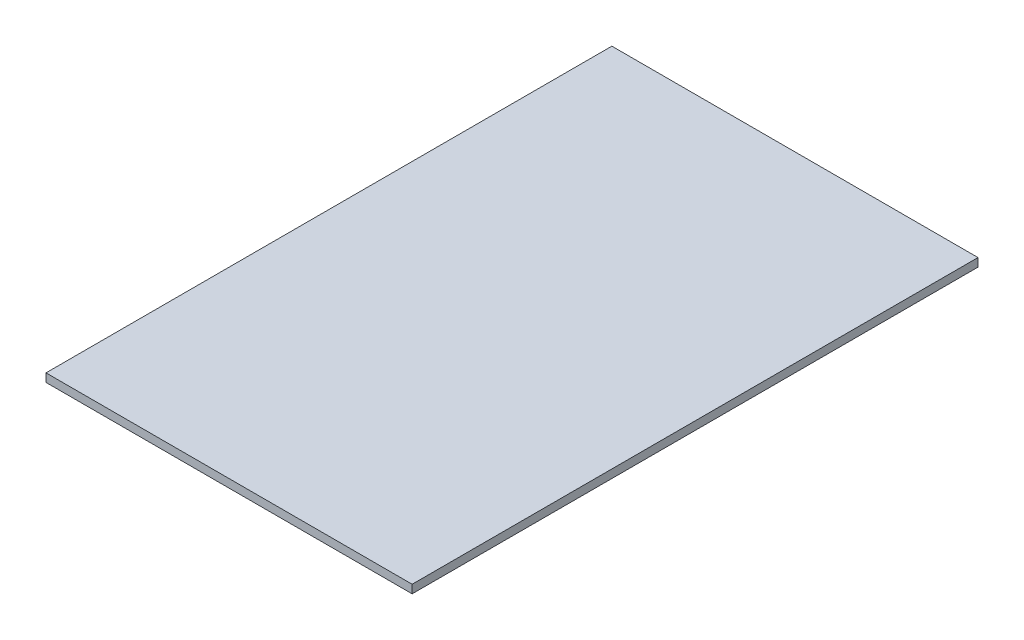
ISO-10303-21;
HEADER;
FILE_DESCRIPTION(('STEP AP214'),'2;1');
FILE_NAME('part.step','',(''),(''),'','','');
FILE_SCHEMA(('AUTOMOTIVE_DESIGN { 1 0 10303 214 1 1 1 1 }'));
ENDSEC;
DATA;
#1=APPLICATION_CONTEXT('core data for automotive mechanical design processes');
#2=APPLICATION_PROTOCOL_DEFINITION('international standard','automotive_design',2000,#1);
#3=PRODUCT_CONTEXT('',#1,'mechanical');
#4=PRODUCT('Part','Part','',(#3));
#5=PRODUCT_RELATED_PRODUCT_CATEGORY('part','',(#4));
#6=PRODUCT_DEFINITION_FORMATION('','',#4);
#7=PRODUCT_DEFINITION_CONTEXT('part definition',#1,'design');
#8=PRODUCT_DEFINITION('design','',#6,#7);
#9=PRODUCT_DEFINITION_SHAPE('','',#8);
#10=(LENGTH_UNIT() NAMED_UNIT(*) SI_UNIT(.MILLI.,.METRE.));
#11=(NAMED_UNIT(*) PLANE_ANGLE_UNIT() SI_UNIT($,.RADIAN.));
#12=(NAMED_UNIT(*) SI_UNIT($,.STERADIAN.) SOLID_ANGLE_UNIT());
#13=UNCERTAINTY_MEASURE_WITH_UNIT(LENGTH_MEASURE(1.E-05),#10,'distance_accuracy_value','');
#14=(GEOMETRIC_REPRESENTATION_CONTEXT(3) GLOBAL_UNCERTAINTY_ASSIGNED_CONTEXT((#13)) GLOBAL_UNIT_ASSIGNED_CONTEXT((#10,
#11,#12)) REPRESENTATION_CONTEXT('',''));
#15=CARTESIAN_POINT('',(0.,0.,0.));
#16=DIRECTION('',(0.,0.,1.));
#17=DIRECTION('',(1.,0.,0.));
#18=AXIS2_PLACEMENT_3D('',#15,#16,#17);
#19=CARTESIAN_POINT('',(139.7,0.,-215.9));
#20=DIRECTION('',(0.,0.,-1.));
#21=DIRECTION('',(-1.,0.,0.));
#22=AXIS2_PLACEMENT_3D('',#19,#20,#21);
#23=PLANE('',#22);
#24=DIRECTION('',(-1.,0.,0.));
#25=VECTOR('',#24,1.);
#26=CARTESIAN_POINT('',(139.7,3.175,-215.9));
#27=LINE('',#26,#25);
#28=CARTESIAN_POINT('',(139.7,3.175,-215.9));
#29=VERTEX_POINT('',#28);
#30=CARTESIAN_POINT('',(0.,3.175,-215.9));
#31=VERTEX_POINT('',#30);
#32=EDGE_CURVE('E94',#29,#31,#27,.T.);
#33=ORIENTED_EDGE('',*,*,#32,.F.);
#34=DIRECTION('',(0.,1.,0.));
#35=VECTOR('',#34,1.);
#36=CARTESIAN_POINT('',(139.7,0.,-215.9));
#37=LINE('',#36,#35);
#38=CARTESIAN_POINT('',(139.7,0.,-215.9));
#39=VERTEX_POINT('',#38);
#40=EDGE_CURVE('E11',#39,#29,#37,.T.);
#41=ORIENTED_EDGE('',*,*,#40,.F.);
#42=DIRECTION('',(-1.,0.,0.));
#43=VECTOR('',#42,1.);
#44=CARTESIAN_POINT('',(139.7,0.,-215.9));
#45=LINE('',#44,#43);
#46=CARTESIAN_POINT('',(0.,0.,-215.9));
#47=VERTEX_POINT('',#46);
#48=EDGE_CURVE('E88',#39,#47,#45,.T.);
#49=ORIENTED_EDGE('',*,*,#48,.T.);
#50=DIRECTION('',(0.,1.,0.));
#51=VECTOR('',#50,1.);
#52=CARTESIAN_POINT('',(0.,0.,-215.9));
#53=LINE('',#52,#51);
#54=EDGE_CURVE('E33',#47,#31,#53,.T.);
#55=ORIENTED_EDGE('',*,*,#54,.T.);
#56=EDGE_LOOP('',(#33,#41,#49,#55));
#57=FACE_BOUND('',#56,.T.);
#58=ADVANCED_FACE('F30',(#57),#23,.T.);
#59=CARTESIAN_POINT('',(139.7,0.,0.));
#60=DIRECTION('',(1.,0.,0.));
#61=DIRECTION('',(0.,0.,-1.));
#62=AXIS2_PLACEMENT_3D('',#59,#60,#61);
#63=PLANE('',#62);
#64=DIRECTION('',(0.,0.,-1.));
#65=VECTOR('',#64,1.);
#66=CARTESIAN_POINT('',(139.7,3.175,0.));
#67=LINE('',#66,#65);
#68=CARTESIAN_POINT('',(139.7,3.175,0.));
#69=VERTEX_POINT('',#68);
#70=EDGE_CURVE('E90',#69,#29,#67,.T.);
#71=ORIENTED_EDGE('',*,*,#70,.F.);
#72=DIRECTION('',(0.,1.,0.));
#73=VECTOR('',#72,1.);
#74=CARTESIAN_POINT('',(139.7,0.,0.));
#75=LINE('',#74,#73);
#76=CARTESIAN_POINT('',(139.7,0.,0.));
#77=VERTEX_POINT('',#76);
#78=EDGE_CURVE('E39',#77,#69,#75,.T.);
#79=ORIENTED_EDGE('',*,*,#78,.F.);
#80=DIRECTION('',(0.,0.,-1.));
#81=VECTOR('',#80,1.);
#82=CARTESIAN_POINT('',(139.7,0.,0.));
#83=LINE('',#82,#81);
#84=EDGE_CURVE('E85',#77,#39,#83,.T.);
#85=ORIENTED_EDGE('',*,*,#84,.T.);
#86=ORIENTED_EDGE('',*,*,#40,.T.);
#87=EDGE_LOOP('',(#71,#79,#85,#86));
#88=FACE_BOUND('',#87,.T.);
#89=ADVANCED_FACE('F104',(#88),#63,.T.);
#90=CARTESIAN_POINT('',(0.,0.,0.));
#91=DIRECTION('',(0.,0.,1.));
#92=DIRECTION('',(1.,0.,0.));
#93=AXIS2_PLACEMENT_3D('',#90,#91,#92);
#94=PLANE('',#93);
#95=DIRECTION('',(1.,0.,0.));
#96=VECTOR('',#95,1.);
#97=CARTESIAN_POINT('',(0.,3.175,0.));
#98=LINE('',#97,#96);
#99=CARTESIAN_POINT('',(0.,3.175,0.));
#100=VERTEX_POINT('',#99);
#101=EDGE_CURVE('E80',#100,#69,#98,.T.);
#102=ORIENTED_EDGE('',*,*,#101,.F.);
#103=DIRECTION('',(0.,1.,0.));
#104=VECTOR('',#103,1.);
#105=CARTESIAN_POINT('',(0.,0.,0.));
#106=LINE('',#105,#104);
#107=CARTESIAN_POINT('',(0.,0.,0.));
#108=VERTEX_POINT('',#107);
#109=EDGE_CURVE('E75',#108,#100,#106,.T.);
#110=ORIENTED_EDGE('',*,*,#109,.F.);
#111=DIRECTION('',(1.,0.,0.));
#112=VECTOR('',#111,1.);
#113=CARTESIAN_POINT('',(0.,0.,0.));
#114=LINE('',#113,#112);
#115=EDGE_CURVE('E78',#108,#77,#114,.T.);
#116=ORIENTED_EDGE('',*,*,#115,.T.);
#117=ORIENTED_EDGE('',*,*,#78,.T.);
#118=EDGE_LOOP('',(#102,#110,#116,#117));
#119=FACE_BOUND('',#118,.T.);
#120=ADVANCED_FACE('F77',(#119),#94,.T.);
#121=CARTESIAN_POINT('',(0.,0.,-215.9));
#122=DIRECTION('',(-1.,0.,0.));
#123=DIRECTION('',(0.,0.,1.));
#124=AXIS2_PLACEMENT_3D('',#121,#122,#123);
#125=PLANE('',#124);
#126=DIRECTION('',(0.,0.,1.));
#127=VECTOR('',#126,1.);
#128=CARTESIAN_POINT('',(0.,3.175,-215.9));
#129=LINE('',#128,#127);
#130=EDGE_CURVE('E97',#31,#100,#129,.T.);
#131=ORIENTED_EDGE('',*,*,#130,.F.);
#132=ORIENTED_EDGE('',*,*,#54,.F.);
#133=DIRECTION('',(0.,0.,1.));
#134=VECTOR('',#133,1.);
#135=CARTESIAN_POINT('',(0.,0.,-215.9));
#136=LINE('',#135,#134);
#137=EDGE_CURVE('E84',#47,#108,#136,.T.);
#138=ORIENTED_EDGE('',*,*,#137,.T.);
#139=ORIENTED_EDGE('',*,*,#109,.T.);
#140=EDGE_LOOP('',(#131,#132,#138,#139));
#141=FACE_BOUND('',#140,.T.);
#142=ADVANCED_FACE('F87',(#141),#125,.T.);
#143=CARTESIAN_POINT('',(0.,0.,-215.9));
#144=DIRECTION('',(0.,1.,0.));
#145=DIRECTION('',(0.,0.,1.));
#146=AXIS2_PLACEMENT_3D('',#143,#144,#145);
#147=PLANE('',#146);
#148=ORIENTED_EDGE('',*,*,#48,.F.);
#149=ORIENTED_EDGE('',*,*,#84,.F.);
#150=ORIENTED_EDGE('',*,*,#115,.F.);
#151=ORIENTED_EDGE('',*,*,#137,.F.);
#152=EDGE_LOOP('',(#148,#149,#150,#151));
#153=FACE_BOUND('',#152,.T.);
#154=ADVANCED_FACE('F83',(#153),#147,.F.);
#155=CARTESIAN_POINT('',(0.,3.175,-215.9));
#156=DIRECTION('',(0.,1.,0.));
#157=DIRECTION('',(0.,0.,1.));
#158=AXIS2_PLACEMENT_3D('',#155,#156,#157);
#159=PLANE('',#158);
#160=ORIENTED_EDGE('',*,*,#32,.T.);
#161=ORIENTED_EDGE('',*,*,#130,.T.);
#162=ORIENTED_EDGE('',*,*,#101,.T.);
#163=ORIENTED_EDGE('',*,*,#70,.T.);
#164=EDGE_LOOP('',(#160,#161,#162,#163));
#165=FACE_BOUND('',#164,.T.);
#166=ADVANCED_FACE('F103',(#165),#159,.T.);
#167=CLOSED_SHELL('',(#58,#89,#120,#142,#154,#166));
#168=MANIFOLD_SOLID_BREP('B2',#167);
#169=ADVANCED_BREP_SHAPE_REPRESENTATION('',(#18,#168),#14);
#170=SHAPE_DEFINITION_REPRESENTATION(#9,#169);
ENDSEC;
END-ISO-10303-21;
